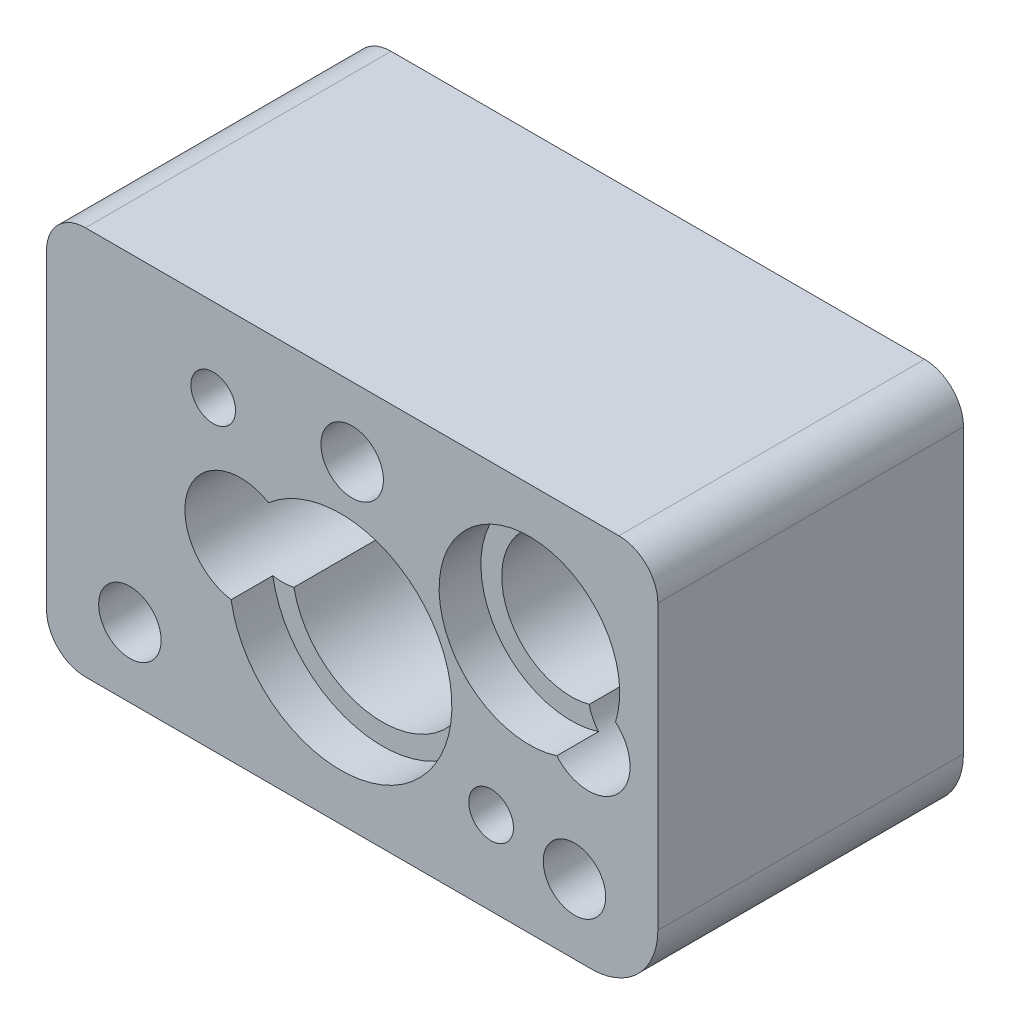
from build123d import *

# Parameters (mm, degrees)
BOSS_EXTRUDE1_DEPTH      = 3.175
BOSS_EXTRUDE1_DEPTH_BACK = 31.75
HOLE1_D                  = 12.7
HOLE11_D                 = 9.525
HOLE12_D                 = 15.875
HOLE12_CBORE_D           = 20.6375
HOLE12_CBORE_DEPTH       = 4.7752
HOLE13_D                 = 20.6375
HOLE13_CBORE_D           = 25.4
HOLE13_CBORE_DEPTH       = 4.7625
HOLE14_D                 = 7.1374
HOLE14_CBORE_D           = 10.7188
HOLE14_CBORE_DEPTH       = 14.224
HOLE15_D                 = 5.1054
HOLE15_DEPTH             = 34.925
HOLE15_TIP               = 1.533816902


with BuildPart() as part:
    # Sketch1 → Boss-Extrude1 (new, two sides: drawn at the far end of the back side and taken through both)
    with BuildSketch(Plane(origin=(0, 0, 40.2082), x_dir=(-1, 0, 0), z_dir=(0, 0, -1)).offset(-BOSS_EXTRUDE1_DEPTH_BACK)):
        with BuildLine():
            Line((837.088295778, -8.725406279), (898.048295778, -8.725406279))
            ThreePointArc((898.048295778, -8.725406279), (901.191385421, -10.027316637), (902.493295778, -13.170406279))
            Line((902.493295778, -13.170406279), (902.493295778, -48.730406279))
            ThreePointArc((902.493295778, -48.730406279), (901.191385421, -51.873495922), (898.048295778, -53.175406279))
            Line((898.048295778, -53.175406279), (840.263295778, -53.175406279))
            ThreePointArc((840.263295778, -53.175406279), (834.875142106, -50.943559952), (832.643295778, -45.555406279))
            Line((832.643295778, -45.555406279), (832.643295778, -13.170406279))
            ThreePointArc((832.643295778, -13.170406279), (833.945206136, -10.027316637), (837.088295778, -8.725406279))
        make_face()
    extrude(amount=BOSS_EXTRUDE1_DEPTH + BOSS_EXTRUDE1_DEPTH_BACK)

    # Hole1 (through all)
    with Locations(Plane(origin=(-883.986056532, -20.349265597, 71.9582), x_dir=(1, 0, 0), z_dir=(0, 0, 1))):
        with Locations((3.654260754, -10.601140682)):
            Hole(HOLE1_D / 2)

    # Hole11 (through all)
    with Locations(Plane(origin=(-844.235056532, -20.349265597, 71.9582), x_dir=(1, 0, 0), z_dir=(0, 0, 1))):
        with Locations((3.654260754, -10.601140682)):
            Hole(HOLE11_D / 2)

    # Hole12 (through all)
    with Locations(Plane(origin=(-860.185094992, -23.280214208, 71.9582), x_dir=(1, 0, 0), z_dir=(0, 0, 1))):
        with Locations((12.869107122, -0.934999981)):
            CounterBoreHole(HOLE12_D / 2, HOLE12_CBORE_D / 2, HOLE12_CBORE_DEPTH)

    # Hole13 (through all)
    with Locations(Plane(origin=(-881.744170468, -34.185315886, 71.9582), x_dir=(1, 0, 0), z_dir=(0, 0, 1))):
        with Locations((12.869107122, -0.934999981)):
            CounterBoreHole(HOLE13_D / 2, HOLE13_CBORE_D / 2, HOLE13_CBORE_DEPTH)

    # Hole14 (through all)
    with Locations(Plane(origin=(-829.299188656, -44.302906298, 37.0332), x_dir=(-1, 0, 0), z_dir=(0, 0, -1))):
        with Locations((12.869107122, -0.934999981), (63.669107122, -0.934999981), (38.269107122, 27.640000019)):
            CounterBoreHole(HOLE14_D / 2, HOLE14_CBORE_D / 2, HOLE14_CBORE_DEPTH)

    # Hole15
    with Locations(Plane(origin=(-865.906751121, -34.482640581, 71.9582), x_dir=(1, 0, 0), z_dir=(0, 0, 1))):
        with Locations((14.213455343, -9.167765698), (-17.536544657, 16.232234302)):
            Hole(HOLE15_D / 2, depth=HOLE15_DEPTH)
            with Locations((0, 0, -(HOLE15_DEPTH + HOLE15_TIP / 2))):  # 118° drill point
                Cone(0, HOLE15_D / 2, HOLE15_TIP, mode=Mode.SUBTRACT)


solid = part.part
